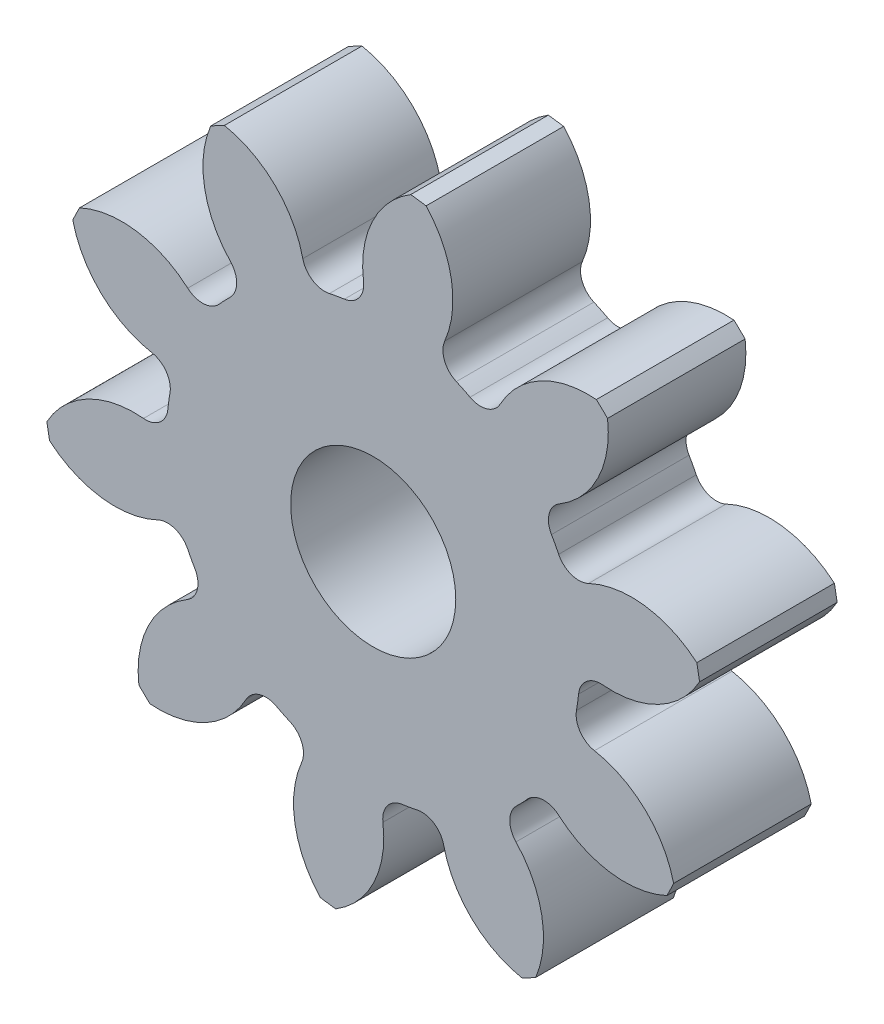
from build123d import *

# Parameters (mm, degrees)
SKETCH3_R         = 304.8
GEARBODY_DEPTH    = 127
TOOTHCUT_DEPTH    = 450.371872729
CIRPATTERN1_COUNT = 10
BOREDIA_R         = 76.2
BORE_DEPTH        = 12700


with BuildPart() as part:
    # Sketch3 → gearBody (new body)
    with BuildSketch(Plane.XY):
        Circle(SKETCH3_R)
    extrude(amount=GEARBODY_DEPTH)

    # Sketch2 → toothCut (cut, through all)
    with BuildSketch(Plane.XY):
        with BuildLine():
            ThreePointArc((187.615755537, -33.02390459), (188.70830176, -26.065817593), (189.542884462, -19.072098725))
            ThreePointArc((189.542884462, -19.072098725), (196.967168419, -5.185073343), (212.017913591, -0.554248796))
            ThreePointArc((212.017913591, -0.554248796), (267.134360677, 11.695810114), (304.8, 53.757506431))
            ThreePointArc((304.8, 53.757506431), (306.593334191, -42.348989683), (278.814305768, -134.370727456))
            ThreePointArc((278.814305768, -134.370727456), (253.961234, -83.673474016), (204.229353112, -56.940971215))
            ThreePointArc((204.229353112, -56.940971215), (190.997506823, -48.403541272), (187.615755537, -33.02390459))
        make_face()
    toothcut = extrude(amount=TOOTHCUT_DEPTH, mode=Mode.SUBTRACT)

    # CirPattern1: toothCut ×10 about axis
    cirpattern1_axis = Axis((0, 0, 0), (0, 0, 1))
    for i in range(1, CIRPATTERN1_COUNT):
        add(toothcut.rotate(cirpattern1_axis, i * 360 / CIRPATTERN1_COUNT), mode=Mode.SUBTRACT)

    # boreDia → bore (cut, symmetric)
    with BuildSketch(Plane.XY):
        Circle(BOREDIA_R)
    extrude(amount=BORE_DEPTH, both=True, mode=Mode.SUBTRACT)


solid = part.part
